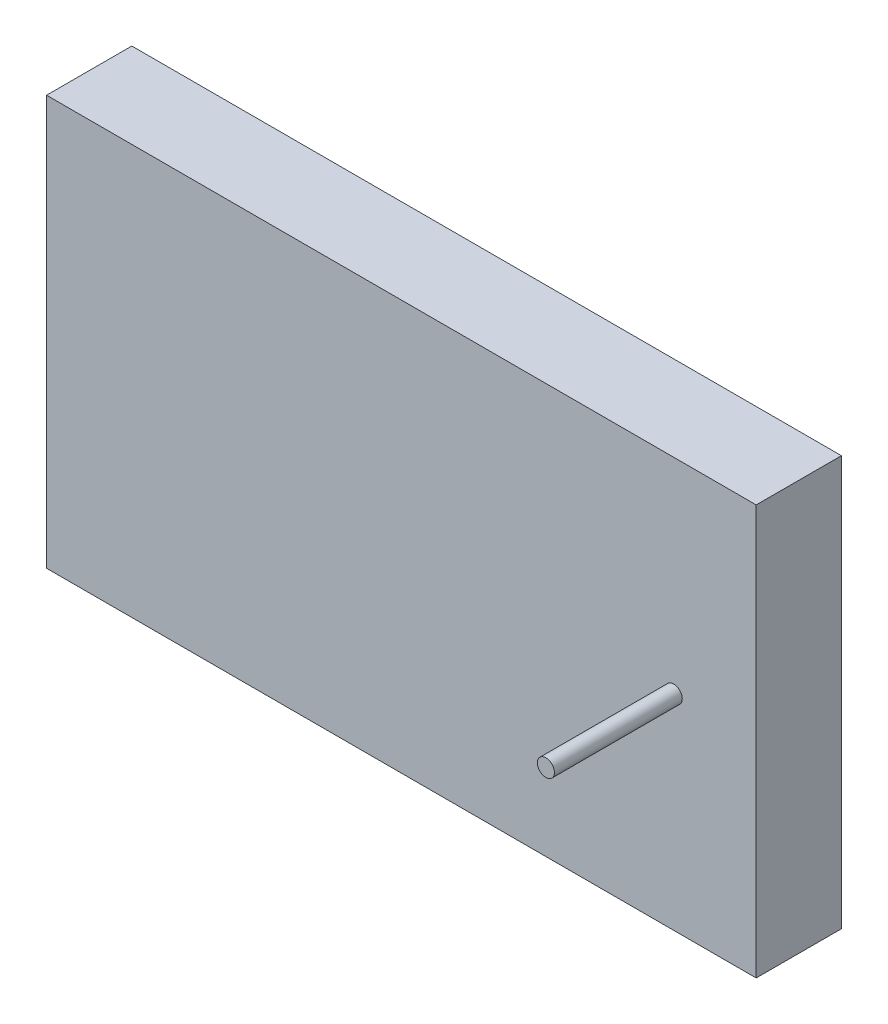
from build123d import *

# Parameters (mm, degrees)
SKIZZE2_W               = 1
SKIZZE2_H               = 25
SKIZZE1_W               = 83.269104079
SKIZZE1_H               = 48.078030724
LINEAR_AUSTRAGEN1_DEPTH = 10


with BuildPart() as part:
    # Skizze2 → Rotation1 (revolve)
    with BuildSketch(Plane(origin=(0, 24.039015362, 0), x_dir=(-1, 0, 0), z_dir=(0, 1, 0))):
        with Locations((-74.092574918, 12.5)):
            Rectangle(SKIZZE2_W, SKIZZE2_H)
    revolve(axis=Axis((73.592574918, 24.039015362, 33.128520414), (0, 0, -1)))

    # Skizze1 → Linear austragen1 (add)
    with BuildSketch(Plane.XY):
        with Locations((41.63455204, 24.039015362)):
            Rectangle(SKIZZE1_W, SKIZZE1_H)
    extrude(amount=LINEAR_AUSTRAGEN1_DEPTH)


solid = part.part
